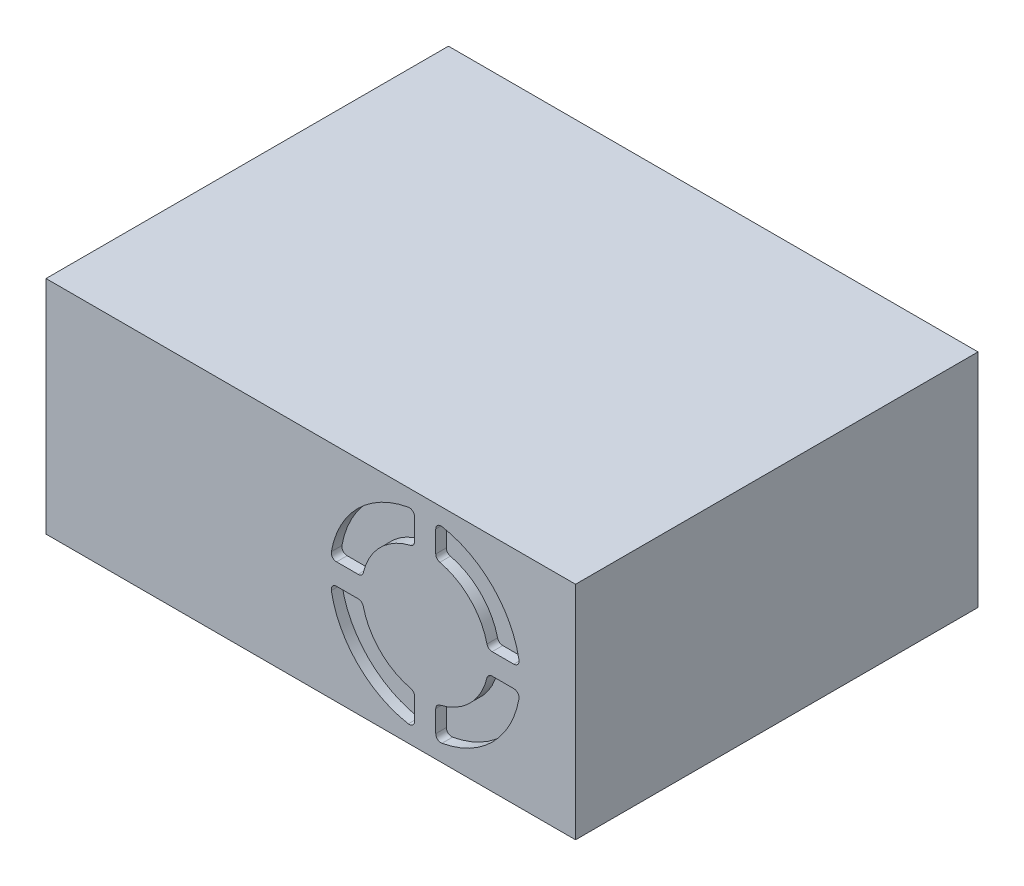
ISO-10303-21;
HEADER;
FILE_DESCRIPTION(('STEP AP214'),'2;1');
FILE_NAME('part.step','',(''),(''),'','','');
FILE_SCHEMA(('AUTOMOTIVE_DESIGN { 1 0 10303 214 1 1 1 1 }'));
ENDSEC;
DATA;
#1=APPLICATION_CONTEXT('core data for automotive mechanical design processes');
#2=APPLICATION_PROTOCOL_DEFINITION('international standard','automotive_design',2000,#1);
#3=PRODUCT_CONTEXT('',#1,'mechanical');
#4=PRODUCT('Part','Part','',(#3));
#5=PRODUCT_RELATED_PRODUCT_CATEGORY('part','',(#4));
#6=PRODUCT_DEFINITION_FORMATION('','',#4);
#7=PRODUCT_DEFINITION_CONTEXT('part definition',#1,'design');
#8=PRODUCT_DEFINITION('design','',#6,#7);
#9=PRODUCT_DEFINITION_SHAPE('','',#8);
#10=(LENGTH_UNIT() NAMED_UNIT(*) SI_UNIT(.MILLI.,.METRE.));
#11=(NAMED_UNIT(*) PLANE_ANGLE_UNIT() SI_UNIT($,.RADIAN.));
#12=(NAMED_UNIT(*) SI_UNIT($,.STERADIAN.) SOLID_ANGLE_UNIT());
#13=UNCERTAINTY_MEASURE_WITH_UNIT(LENGTH_MEASURE(1.E-05),#10,'distance_accuracy_value','');
#14=(GEOMETRIC_REPRESENTATION_CONTEXT(3) GLOBAL_UNCERTAINTY_ASSIGNED_CONTEXT((#13)) GLOBAL_UNIT_ASSIGNED_CONTEXT((#10,
#11,#12)) REPRESENTATION_CONTEXT('',''));
#15=CARTESIAN_POINT('',(0.,0.,0.));
#16=DIRECTION('',(0.,0.,1.));
#17=DIRECTION('',(1.,0.,0.));
#18=AXIS2_PLACEMENT_3D('',#15,#16,#17);
#19=CARTESIAN_POINT('',(0.,20.9,0.));
#20=DIRECTION('',(1.,0.,0.));
#21=DIRECTION('',(0.,0.,-1.));
#22=AXIS2_PLACEMENT_3D('',#19,#20,#21);
#23=PLANE('',#22);
#24=DIRECTION('',(0.,0.,1.));
#25=VECTOR('',#24,1.);
#26=CARTESIAN_POINT('',(0.,0.,0.));
#27=LINE('',#26,#25);
#28=CARTESIAN_POINT('',(0.,0.,-38.));
#29=VERTEX_POINT('',#28);
#30=CARTESIAN_POINT('',(0.,0.,0.));
#31=VERTEX_POINT('',#30);
#32=EDGE_CURVE('E513',#29,#31,#27,.T.);
#33=ORIENTED_EDGE('',*,*,#32,.T.);
#34=DIRECTION('',(0.,-1.,0.));
#35=VECTOR('',#34,1.);
#36=CARTESIAN_POINT('',(0.,20.9,0.));
#37=LINE('',#36,#35);
#38=CARTESIAN_POINT('',(0.,20.9,0.));
#39=VERTEX_POINT('',#38);
#40=EDGE_CURVE('E11',#39,#31,#37,.T.);
#41=ORIENTED_EDGE('',*,*,#40,.F.);
#42=DIRECTION('',(0.,0.,1.));
#43=VECTOR('',#42,1.);
#44=CARTESIAN_POINT('',(0.,20.9,0.));
#45=LINE('',#44,#43);
#46=CARTESIAN_POINT('',(0.,20.9,-38.));
#47=VERTEX_POINT('',#46);
#48=EDGE_CURVE('E528',#47,#39,#45,.T.);
#49=ORIENTED_EDGE('',*,*,#48,.F.);
#50=DIRECTION('',(0.,-1.,0.));
#51=VECTOR('',#50,1.);
#52=CARTESIAN_POINT('',(0.,20.9,-38.));
#53=LINE('',#52,#51);
#54=EDGE_CURVE('E538',#47,#29,#53,.T.);
#55=ORIENTED_EDGE('',*,*,#54,.T.);
#56=EDGE_LOOP('',(#33,#41,#49,#55));
#57=FACE_BOUND('',#56,.T.);
#58=ADVANCED_FACE('F33',(#57),#23,.F.);
#59=CARTESIAN_POINT('',(0.,20.9,0.));
#60=DIRECTION('',(0.,0.,-1.));
#61=DIRECTION('',(-1.,0.,0.));
#62=AXIS2_PLACEMENT_3D('',#59,#60,#61);
#63=PLANE('',#62);
#64=CARTESIAN_POINT('',(35.8,10.45,0.));
#65=DIRECTION('',(0.,0.,-1.));
#66=DIRECTION('',(1.,0.,0.));
#67=AXIS2_PLACEMENT_3D('',#64,#65,#66);
#68=CIRCLE('',#67,5.99999999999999);
#69=CARTESIAN_POINT('',(29.9619489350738,11.8346153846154,0.));
#70=VERTEX_POINT('',#69);
#71=CARTESIAN_POINT('',(34.4153846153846,16.2880510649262,0.));
#72=VERTEX_POINT('',#71);
#73=EDGE_CURVE('E430',#70,#72,#68,.T.);
#74=ORIENTED_EDGE('',*,*,#73,.F.);
#75=CARTESIAN_POINT('',(29.4754446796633,11.95,0.));
#76=DIRECTION('',(0.,0.,1.));
#77=DIRECTION('',(-1.,0.,0.));
#78=AXIS2_PLACEMENT_3D('',#75,#76,#77);
#79=CIRCLE('',#78,0.499999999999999);
#80=CARTESIAN_POINT('',(29.4754446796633,11.45,0.));
#81=VERTEX_POINT('',#80);
#82=EDGE_CURVE('E47',#81,#70,#79,.T.);
#83=ORIENTED_EDGE('',*,*,#82,.F.);
#84=DIRECTION('',(1.,0.,0.));
#85=VECTOR('',#84,1.);
#86=CARTESIAN_POINT('',(27.4333997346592,11.45,0.));
#87=LINE('',#86,#85);
#88=CARTESIAN_POINT('',(27.4333997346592,11.45,0.));
#89=VERTEX_POINT('',#88);
#90=EDGE_CURVE('E407',#89,#81,#87,.T.);
#91=ORIENTED_EDGE('',*,*,#90,.F.);
#92=CARTESIAN_POINT('',(27.4333997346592,11.95,0.));
#93=DIRECTION('',(0.,0.,1.));
#94=DIRECTION('',(-1.,0.,0.));
#95=AXIS2_PLACEMENT_3D('',#92,#93,#94);
#96=CIRCLE('',#95,0.500000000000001);
#97=CARTESIAN_POINT('',(26.9412467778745,12.0382352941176,0.));
#98=VERTEX_POINT('',#97);
#99=EDGE_CURVE('E445',#98,#89,#96,.T.);
#100=ORIENTED_EDGE('',*,*,#99,.F.);
#101=CARTESIAN_POINT('',(35.8,10.45,0.));
#102=DIRECTION('',(0.,0.,1.));
#103=DIRECTION('',(1.,0.,0.));
#104=AXIS2_PLACEMENT_3D('',#101,#102,#103);
#105=CIRCLE('',#104,9.);
#106=CARTESIAN_POINT('',(34.2117647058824,19.3087532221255,0.));
#107=VERTEX_POINT('',#106);
#108=EDGE_CURVE('E442',#107,#98,#105,.T.);
#109=ORIENTED_EDGE('',*,*,#108,.F.);
#110=CARTESIAN_POINT('',(34.3,18.8166002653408,0.));
#111=DIRECTION('',(0.,0.,1.));
#112=DIRECTION('',(-1.,0.,0.));
#113=AXIS2_PLACEMENT_3D('',#110,#111,#112);
#114=CIRCLE('',#113,0.500000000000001);
#115=CARTESIAN_POINT('',(34.8,18.8166002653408,0.));
#116=VERTEX_POINT('',#115);
#117=EDGE_CURVE('E439',#116,#107,#114,.T.);
#118=ORIENTED_EDGE('',*,*,#117,.F.);
#119=DIRECTION('',(0.,1.,0.));
#120=VECTOR('',#119,1.);
#121=CARTESIAN_POINT('',(34.8,18.8166002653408,0.));
#122=LINE('',#121,#120);
#123=CARTESIAN_POINT('',(34.8,16.7745553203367,0.));
#124=VERTEX_POINT('',#123);
#125=EDGE_CURVE('E436',#124,#116,#122,.T.);
#126=ORIENTED_EDGE('',*,*,#125,.F.);
#127=CARTESIAN_POINT('',(34.3,16.7745553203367,0.));
#128=DIRECTION('',(0.,0.,1.));
#129=DIRECTION('',(-1.,0.,0.));
#130=AXIS2_PLACEMENT_3D('',#127,#128,#129);
#131=CIRCLE('',#130,0.499999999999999);
#132=EDGE_CURVE('E433',#72,#124,#131,.T.);
#133=ORIENTED_EDGE('',*,*,#132,.F.);
#134=EDGE_LOOP('',(#74,#83,#91,#100,#109,#118,#126,#133));
#135=FACE_BOUND('',#134,.T.);
#136=DIRECTION('',(0.,1.,0.));
#137=VECTOR('',#136,1.);
#138=CARTESIAN_POINT('',(34.8,4.12544467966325,0.));
#139=LINE('',#138,#137);
#140=CARTESIAN_POINT('',(34.8,2.08339973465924,0.));
#141=VERTEX_POINT('',#140);
#142=CARTESIAN_POINT('',(34.8,4.12544467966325,0.));
#143=VERTEX_POINT('',#142);
#144=EDGE_CURVE('E368',#141,#143,#139,.T.);
#145=ORIENTED_EDGE('',*,*,#144,.F.);
#146=CARTESIAN_POINT('',(34.3,2.08339973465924,0.));
#147=DIRECTION('',(0.,0.,1.));
#148=DIRECTION('',(1.,0.,0.));
#149=AXIS2_PLACEMENT_3D('',#146,#147,#148);
#150=CIRCLE('',#149,0.500000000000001);
#151=CARTESIAN_POINT('',(34.2117647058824,1.59124677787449,0.));
#152=VERTEX_POINT('',#151);
#153=EDGE_CURVE('E55',#152,#141,#150,.T.);
#154=ORIENTED_EDGE('',*,*,#153,.F.);
#155=CARTESIAN_POINT('',(35.8,10.45,0.));
#156=DIRECTION('',(0.,0.,1.));
#157=DIRECTION('',(1.,0.,0.));
#158=AXIS2_PLACEMENT_3D('',#155,#156,#157);
#159=CIRCLE('',#158,9.);
#160=CARTESIAN_POINT('',(26.9412467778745,8.86176470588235,0.));
#161=VERTEX_POINT('',#160);
#162=EDGE_CURVE('E345',#161,#152,#159,.T.);
#163=ORIENTED_EDGE('',*,*,#162,.F.);
#164=CARTESIAN_POINT('',(27.4333997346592,8.95,0.));
#165=DIRECTION('',(0.,0.,1.));
#166=DIRECTION('',(1.,0.,0.));
#167=AXIS2_PLACEMENT_3D('',#164,#165,#166);
#168=CIRCLE('',#167,0.500000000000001);
#169=CARTESIAN_POINT('',(27.4333997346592,9.45,0.));
#170=VERTEX_POINT('',#169);
#171=EDGE_CURVE('E384',#170,#161,#168,.T.);
#172=ORIENTED_EDGE('',*,*,#171,.F.);
#173=DIRECTION('',(-1.,0.,0.));
#174=VECTOR('',#173,1.);
#175=CARTESIAN_POINT('',(27.4333997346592,9.45,0.));
#176=LINE('',#175,#174);
#177=CARTESIAN_POINT('',(29.4754446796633,9.45,0.));
#178=VERTEX_POINT('',#177);
#179=EDGE_CURVE('E381',#178,#170,#176,.T.);
#180=ORIENTED_EDGE('',*,*,#179,.F.);
#181=CARTESIAN_POINT('',(29.4754446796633,8.95,0.));
#182=DIRECTION('',(0.,0.,1.));
#183=DIRECTION('',(1.,0.,0.));
#184=AXIS2_PLACEMENT_3D('',#181,#182,#183);
#185=CIRCLE('',#184,0.499999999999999);
#186=CARTESIAN_POINT('',(29.9619489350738,9.06538461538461,0.));
#187=VERTEX_POINT('',#186);
#188=EDGE_CURVE('E378',#187,#178,#185,.T.);
#189=ORIENTED_EDGE('',*,*,#188,.F.);
#190=CARTESIAN_POINT('',(35.8,10.45,0.));
#191=DIRECTION('',(0.,0.,-1.));
#192=DIRECTION('',(1.,0.,0.));
#193=AXIS2_PLACEMENT_3D('',#190,#191,#192);
#194=CIRCLE('',#193,5.99999999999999);
#195=CARTESIAN_POINT('',(34.4153846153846,4.61194893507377,0.));
#196=VERTEX_POINT('',#195);
#197=EDGE_CURVE('E375',#196,#187,#194,.T.);
#198=ORIENTED_EDGE('',*,*,#197,.F.);
#199=CARTESIAN_POINT('',(34.3,4.12544467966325,0.));
#200=DIRECTION('',(0.,0.,1.));
#201=DIRECTION('',(-1.,0.,0.));
#202=AXIS2_PLACEMENT_3D('',#199,#200,#201);
#203=CIRCLE('',#202,0.5);
#204=EDGE_CURVE('E372',#143,#196,#203,.T.);
#205=ORIENTED_EDGE('',*,*,#204,.F.);
#206=EDGE_LOOP('',(#145,#154,#163,#172,#180,#189,#198,#205));
#207=FACE_BOUND('',#206,.T.);
#208=DIRECTION('',(-1.,0.,0.));
#209=VECTOR('',#208,1.);
#210=CARTESIAN_POINT('',(42.1245553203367,9.45,0.));
#211=LINE('',#210,#209);
#212=CARTESIAN_POINT('',(44.1666002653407,9.45,0.));
#213=VERTEX_POINT('',#212);
#214=CARTESIAN_POINT('',(42.1245553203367,9.45,0.));
#215=VERTEX_POINT('',#214);
#216=EDGE_CURVE('E310',#213,#215,#211,.T.);
#217=ORIENTED_EDGE('',*,*,#216,.F.);
#218=CARTESIAN_POINT('',(44.1666002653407,8.95,0.));
#219=DIRECTION('',(0.,0.,1.));
#220=DIRECTION('',(1.,0.,0.));
#221=AXIS2_PLACEMENT_3D('',#218,#219,#220);
#222=CIRCLE('',#221,0.500000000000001);
#223=CARTESIAN_POINT('',(44.6587532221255,8.86176470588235,0.));
#224=VERTEX_POINT('',#223);
#225=EDGE_CURVE('E272',#224,#213,#222,.T.);
#226=ORIENTED_EDGE('',*,*,#225,.F.);
#227=CARTESIAN_POINT('',(35.8,10.45,0.));
#228=DIRECTION('',(0.,0.,1.));
#229=DIRECTION('',(1.,0.,0.));
#230=AXIS2_PLACEMENT_3D('',#227,#228,#229);
#231=CIRCLE('',#230,9.);
#232=CARTESIAN_POINT('',(37.3882352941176,1.59124677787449,0.));
#233=VERTEX_POINT('',#232);
#234=EDGE_CURVE('E290',#233,#224,#231,.T.);
#235=ORIENTED_EDGE('',*,*,#234,.F.);
#236=CARTESIAN_POINT('',(37.3,2.08339973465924,0.));
#237=DIRECTION('',(0.,0.,1.));
#238=DIRECTION('',(-1.,0.,0.));
#239=AXIS2_PLACEMENT_3D('',#236,#237,#238);
#240=CIRCLE('',#239,0.500000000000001);
#241=CARTESIAN_POINT('',(36.8,2.08339973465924,0.));
#242=VERTEX_POINT('',#241);
#243=EDGE_CURVE('E293',#242,#233,#240,.T.);
#244=ORIENTED_EDGE('',*,*,#243,.F.);
#245=DIRECTION('',(0.,-1.,0.));
#246=VECTOR('',#245,1.);
#247=CARTESIAN_POINT('',(36.8,4.12544467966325,0.));
#248=LINE('',#247,#246);
#249=CARTESIAN_POINT('',(36.8,4.12544467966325,0.));
#250=VERTEX_POINT('',#249);
#251=EDGE_CURVE('E322',#250,#242,#248,.T.);
#252=ORIENTED_EDGE('',*,*,#251,.F.);
#253=CARTESIAN_POINT('',(37.3,4.12544467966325,0.));
#254=DIRECTION('',(0.,0.,1.));
#255=DIRECTION('',(1.,0.,0.));
#256=AXIS2_PLACEMENT_3D('',#253,#254,#255);
#257=CIRCLE('',#256,0.5);
#258=CARTESIAN_POINT('',(37.1846153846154,4.61194893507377,0.));
#259=VERTEX_POINT('',#258);
#260=EDGE_CURVE('E319',#259,#250,#257,.T.);
#261=ORIENTED_EDGE('',*,*,#260,.F.);
#262=CARTESIAN_POINT('',(35.8,10.45,0.));
#263=DIRECTION('',(0.,0.,-1.));
#264=DIRECTION('',(1.,0.,0.));
#265=AXIS2_PLACEMENT_3D('',#262,#263,#264);
#266=CIRCLE('',#265,5.99999999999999);
#267=CARTESIAN_POINT('',(41.6380510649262,9.06538461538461,0.));
#268=VERTEX_POINT('',#267);
#269=EDGE_CURVE('E316',#268,#259,#266,.T.);
#270=ORIENTED_EDGE('',*,*,#269,.F.);
#271=CARTESIAN_POINT('',(42.1245553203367,8.95,0.));
#272=DIRECTION('',(0.,0.,1.));
#273=DIRECTION('',(1.,0.,0.));
#274=AXIS2_PLACEMENT_3D('',#271,#272,#273);
#275=CIRCLE('',#274,0.499999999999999);
#276=EDGE_CURVE('E313',#215,#268,#275,.T.);
#277=ORIENTED_EDGE('',*,*,#276,.F.);
#278=EDGE_LOOP('',(#217,#226,#235,#244,#252,#261,#270,#277));
#279=FACE_BOUND('',#278,.T.);
#280=DIRECTION('',(0.,-1.,0.));
#281=VECTOR('',#280,1.);
#282=CARTESIAN_POINT('',(36.8,18.8166002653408,0.));
#283=LINE('',#282,#281);
#284=CARTESIAN_POINT('',(36.8,18.8166002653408,0.));
#285=VERTEX_POINT('',#284);
#286=CARTESIAN_POINT('',(36.8,16.7745553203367,0.));
#287=VERTEX_POINT('',#286);
#288=EDGE_CURVE('E491',#285,#287,#283,.T.);
#289=ORIENTED_EDGE('',*,*,#288,.F.);
#290=CARTESIAN_POINT('',(37.3,18.8166002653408,0.));
#291=DIRECTION('',(0.,0.,1.));
#292=DIRECTION('',(1.,0.,0.));
#293=AXIS2_PLACEMENT_3D('',#290,#291,#292);
#294=CIRCLE('',#293,0.500000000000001);
#295=CARTESIAN_POINT('',(37.3882352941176,19.3087532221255,0.));
#296=VERTEX_POINT('',#295);
#297=EDGE_CURVE('E329',#296,#285,#294,.T.);
#298=ORIENTED_EDGE('',*,*,#297,.F.);
#299=CARTESIAN_POINT('',(35.8,10.45,0.));
#300=DIRECTION('',(0.,0.,1.));
#301=DIRECTION('',(1.,0.,0.));
#302=AXIS2_PLACEMENT_3D('',#299,#300,#301);
#303=CIRCLE('',#302,9.);
#304=CARTESIAN_POINT('',(44.6587532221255,12.0382352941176,0.));
#305=VERTEX_POINT('',#304);
#306=EDGE_CURVE('E468',#305,#296,#303,.T.);
#307=ORIENTED_EDGE('',*,*,#306,.F.);
#308=CARTESIAN_POINT('',(44.1666002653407,11.95,0.));
#309=DIRECTION('',(0.,0.,1.));
#310=DIRECTION('',(-1.,0.,0.));
#311=AXIS2_PLACEMENT_3D('',#308,#309,#310);
#312=CIRCLE('',#311,0.500000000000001);
#313=CARTESIAN_POINT('',(44.1666002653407,11.45,0.));
#314=VERTEX_POINT('',#313);
#315=EDGE_CURVE('E506',#314,#305,#312,.T.);
#316=ORIENTED_EDGE('',*,*,#315,.F.);
#317=DIRECTION('',(1.,0.,0.));
#318=VECTOR('',#317,1.);
#319=CARTESIAN_POINT('',(42.1245553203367,11.45,0.));
#320=LINE('',#319,#318);
#321=CARTESIAN_POINT('',(42.1245553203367,11.45,0.));
#322=VERTEX_POINT('',#321);
#323=EDGE_CURVE('E503',#322,#314,#320,.T.);
#324=ORIENTED_EDGE('',*,*,#323,.F.);
#325=CARTESIAN_POINT('',(42.1245553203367,11.95,0.));
#326=DIRECTION('',(0.,0.,1.));
#327=DIRECTION('',(-1.,0.,0.));
#328=AXIS2_PLACEMENT_3D('',#325,#326,#327);
#329=CIRCLE('',#328,0.499999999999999);
#330=CARTESIAN_POINT('',(41.6380510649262,11.8346153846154,0.));
#331=VERTEX_POINT('',#330);
#332=EDGE_CURVE('E500',#331,#322,#329,.T.);
#333=ORIENTED_EDGE('',*,*,#332,.F.);
#334=CARTESIAN_POINT('',(35.8,10.45,0.));
#335=DIRECTION('',(0.,0.,-1.));
#336=DIRECTION('',(1.,0.,0.));
#337=AXIS2_PLACEMENT_3D('',#334,#335,#336);
#338=CIRCLE('',#337,5.99999999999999);
#339=CARTESIAN_POINT('',(37.1846153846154,16.2880510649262,0.));
#340=VERTEX_POINT('',#339);
#341=EDGE_CURVE('E497',#340,#331,#338,.T.);
#342=ORIENTED_EDGE('',*,*,#341,.F.);
#343=CARTESIAN_POINT('',(37.3,16.7745553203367,0.));
#344=DIRECTION('',(0.,0.,1.));
#345=DIRECTION('',(1.,0.,0.));
#346=AXIS2_PLACEMENT_3D('',#343,#344,#345);
#347=CIRCLE('',#346,0.499999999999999);
#348=EDGE_CURVE('E494',#287,#340,#347,.T.);
#349=ORIENTED_EDGE('',*,*,#348,.F.);
#350=EDGE_LOOP('',(#289,#298,#307,#316,#324,#333,#342,#349));
#351=FACE_BOUND('',#350,.T.);
#352=DIRECTION('',(1.,0.,0.));
#353=VECTOR('',#352,1.);
#354=CARTESIAN_POINT('',(0.,0.,0.));
#355=LINE('',#354,#353);
#356=CARTESIAN_POINT('',(50.,0.,0.));
#357=VERTEX_POINT('',#356);
#358=EDGE_CURVE('E541',#31,#357,#355,.T.);
#359=ORIENTED_EDGE('',*,*,#358,.T.);
#360=DIRECTION('',(0.,-1.,0.));
#361=VECTOR('',#360,1.);
#362=CARTESIAN_POINT('',(50.,20.9,0.));
#363=LINE('',#362,#361);
#364=CARTESIAN_POINT('',(50.,20.9,0.));
#365=VERTEX_POINT('',#364);
#366=EDGE_CURVE('E40',#365,#357,#363,.T.);
#367=ORIENTED_EDGE('',*,*,#366,.F.);
#368=DIRECTION('',(1.,0.,0.));
#369=VECTOR('',#368,1.);
#370=CARTESIAN_POINT('',(0.,20.9,0.));
#371=LINE('',#370,#369);
#372=EDGE_CURVE('E531',#39,#365,#371,.T.);
#373=ORIENTED_EDGE('',*,*,#372,.F.);
#374=ORIENTED_EDGE('',*,*,#40,.T.);
#375=EDGE_LOOP('',(#359,#367,#373,#374));
#376=FACE_BOUND('',#375,.T.);
#377=ADVANCED_FACE('F571',(#135,#207,#279,#351,#376),#63,.F.);
#378=CARTESIAN_POINT('',(50.,20.9,0.));
#379=DIRECTION('',(-1.,0.,0.));
#380=DIRECTION('',(0.,0.,1.));
#381=AXIS2_PLACEMENT_3D('',#378,#379,#380);
#382=PLANE('',#381);
#383=DIRECTION('',(0.,0.,-1.));
#384=VECTOR('',#383,1.);
#385=CARTESIAN_POINT('',(50.,0.,0.));
#386=LINE('',#385,#384);
#387=CARTESIAN_POINT('',(50.,0.,-38.));
#388=VERTEX_POINT('',#387);
#389=EDGE_CURVE('E543',#357,#388,#386,.T.);
#390=ORIENTED_EDGE('',*,*,#389,.T.);
#391=DIRECTION('',(0.,-1.,0.));
#392=VECTOR('',#391,1.);
#393=CARTESIAN_POINT('',(50.,20.9,-38.));
#394=LINE('',#393,#392);
#395=CARTESIAN_POINT('',(50.,20.9,-38.));
#396=VERTEX_POINT('',#395);
#397=EDGE_CURVE('E548',#396,#388,#394,.T.);
#398=ORIENTED_EDGE('',*,*,#397,.F.);
#399=DIRECTION('',(0.,0.,-1.));
#400=VECTOR('',#399,1.);
#401=CARTESIAN_POINT('',(50.,20.9,0.));
#402=LINE('',#401,#400);
#403=EDGE_CURVE('E534',#365,#396,#402,.T.);
#404=ORIENTED_EDGE('',*,*,#403,.F.);
#405=ORIENTED_EDGE('',*,*,#366,.T.);
#406=EDGE_LOOP('',(#390,#398,#404,#405));
#407=FACE_BOUND('',#406,.T.);
#408=ADVANCED_FACE('F555',(#407),#382,.F.);
#409=CARTESIAN_POINT('',(0.,20.9,-38.));
#410=DIRECTION('',(0.,0.,1.));
#411=DIRECTION('',(1.,0.,0.));
#412=AXIS2_PLACEMENT_3D('',#409,#410,#411);
#413=PLANE('',#412);
#414=DIRECTION('',(-1.,0.,0.));
#415=VECTOR('',#414,1.);
#416=CARTESIAN_POINT('',(0.,0.,-38.));
#417=LINE('',#416,#415);
#418=EDGE_CURVE('E532',#388,#29,#417,.T.);
#419=ORIENTED_EDGE('',*,*,#418,.T.);
#420=ORIENTED_EDGE('',*,*,#54,.F.);
#421=DIRECTION('',(-1.,0.,0.));
#422=VECTOR('',#421,1.);
#423=CARTESIAN_POINT('',(0.,20.9,-38.));
#424=LINE('',#423,#422);
#425=EDGE_CURVE('E536',#396,#47,#424,.T.);
#426=ORIENTED_EDGE('',*,*,#425,.F.);
#427=ORIENTED_EDGE('',*,*,#397,.T.);
#428=EDGE_LOOP('',(#419,#420,#426,#427));
#429=FACE_BOUND('',#428,.T.);
#430=ADVANCED_FACE('F564',(#429),#413,.F.);
#431=CARTESIAN_POINT('',(0.,20.9,0.));
#432=DIRECTION('',(0.,-1.,0.));
#433=DIRECTION('',(0.,0.,-1.));
#434=AXIS2_PLACEMENT_3D('',#431,#432,#433);
#435=PLANE('',#434);
#436=ORIENTED_EDGE('',*,*,#48,.T.);
#437=ORIENTED_EDGE('',*,*,#372,.T.);
#438=ORIENTED_EDGE('',*,*,#403,.T.);
#439=ORIENTED_EDGE('',*,*,#425,.T.);
#440=EDGE_LOOP('',(#436,#437,#438,#439));
#441=FACE_BOUND('',#440,.T.);
#442=ADVANCED_FACE('F570',(#441),#435,.F.);
#443=CARTESIAN_POINT('',(0.,0.,0.));
#444=DIRECTION('',(0.,-1.,0.));
#445=DIRECTION('',(0.,0.,-1.));
#446=AXIS2_PLACEMENT_3D('',#443,#444,#445);
#447=PLANE('',#446);
#448=ORIENTED_EDGE('',*,*,#32,.F.);
#449=ORIENTED_EDGE('',*,*,#418,.F.);
#450=ORIENTED_EDGE('',*,*,#389,.F.);
#451=ORIENTED_EDGE('',*,*,#358,.F.);
#452=EDGE_LOOP('',(#448,#449,#450,#451));
#453=FACE_BOUND('',#452,.T.);
#454=ADVANCED_FACE('F561',(#453),#447,.T.);
#455=CARTESIAN_POINT('',(37.3,18.8166002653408,-1.));
#456=DIRECTION('',(0.,0.,1.));
#457=DIRECTION('',(1.,0.,0.));
#458=AXIS2_PLACEMENT_3D('',#455,#456,#457);
#459=CYLINDRICAL_SURFACE('',#458,0.500000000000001);
#460=ORIENTED_EDGE('',*,*,#297,.T.);
#461=DIRECTION('',(0.,0.,1.));
#462=VECTOR('',#461,1.);
#463=CARTESIAN_POINT('',(36.8,18.8166002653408,-1.));
#464=LINE('',#463,#462);
#465=CARTESIAN_POINT('',(36.8,18.8166002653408,-1.));
#466=VERTEX_POINT('',#465);
#467=EDGE_CURVE('E489',#466,#285,#464,.T.);
#468=ORIENTED_EDGE('',*,*,#467,.F.);
#469=CARTESIAN_POINT('',(37.3,18.8166002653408,-1.));
#470=DIRECTION('',(0.,0.,1.));
#471=DIRECTION('',(1.,0.,0.));
#472=AXIS2_PLACEMENT_3D('',#469,#470,#471);
#473=CIRCLE('',#472,0.500000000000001);
#474=CARTESIAN_POINT('',(37.3882352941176,19.3087532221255,-1.));
#475=VERTEX_POINT('',#474);
#476=EDGE_CURVE('E464',#475,#466,#473,.T.);
#477=ORIENTED_EDGE('',*,*,#476,.F.);
#478=DIRECTION('',(0.,0.,1.));
#479=VECTOR('',#478,1.);
#480=CARTESIAN_POINT('',(37.3882352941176,19.3087532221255,-1.));
#481=LINE('',#480,#479);
#482=EDGE_CURVE('E511',#475,#296,#481,.T.);
#483=ORIENTED_EDGE('',*,*,#482,.T.);
#484=EDGE_LOOP('',(#460,#468,#477,#483));
#485=FACE_BOUND('',#484,.T.);
#486=ADVANCED_FACE('F586',(#485),#459,.F.);
#487=CARTESIAN_POINT('',(35.8,10.45,-1.));
#488=DIRECTION('',(0.,0.,1.));
#489=DIRECTION('',(1.,0.,0.));
#490=AXIS2_PLACEMENT_3D('',#487,#488,#489);
#491=CYLINDRICAL_SURFACE('',#490,9.);
#492=ORIENTED_EDGE('',*,*,#306,.T.);
#493=ORIENTED_EDGE('',*,*,#482,.F.);
#494=CARTESIAN_POINT('',(35.8,10.45,-1.));
#495=DIRECTION('',(0.,0.,1.));
#496=DIRECTION('',(1.,0.,0.));
#497=AXIS2_PLACEMENT_3D('',#494,#495,#496);
#498=CIRCLE('',#497,9.);
#499=CARTESIAN_POINT('',(44.6587532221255,12.0382352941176,-1.));
#500=VERTEX_POINT('',#499);
#501=EDGE_CURVE('E486',#500,#475,#498,.T.);
#502=ORIENTED_EDGE('',*,*,#501,.F.);
#503=DIRECTION('',(0.,0.,1.));
#504=VECTOR('',#503,1.);
#505=CARTESIAN_POINT('',(44.6587532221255,12.0382352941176,-1.));
#506=LINE('',#505,#504);
#507=EDGE_CURVE('E514',#500,#305,#506,.T.);
#508=ORIENTED_EDGE('',*,*,#507,.T.);
#509=EDGE_LOOP('',(#492,#493,#502,#508));
#510=FACE_BOUND('',#509,.T.);
#511=ADVANCED_FACE('F591',(#510),#491,.F.);
#512=CARTESIAN_POINT('',(44.1666002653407,11.95,-1.));
#513=DIRECTION('',(0.,0.,1.));
#514=DIRECTION('',(1.,0.,0.));
#515=AXIS2_PLACEMENT_3D('',#512,#513,#514);
#516=CYLINDRICAL_SURFACE('',#515,0.500000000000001);
#517=ORIENTED_EDGE('',*,*,#315,.T.);
#518=ORIENTED_EDGE('',*,*,#507,.F.);
#519=CARTESIAN_POINT('',(44.1666002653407,11.95,-1.));
#520=DIRECTION('',(0.,0.,1.));
#521=DIRECTION('',(-1.,0.,0.));
#522=AXIS2_PLACEMENT_3D('',#519,#520,#521);
#523=CIRCLE('',#522,0.500000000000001);
#524=CARTESIAN_POINT('',(44.1666002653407,11.45,-1.));
#525=VERTEX_POINT('',#524);
#526=EDGE_CURVE('E483',#525,#500,#523,.T.);
#527=ORIENTED_EDGE('',*,*,#526,.F.);
#528=DIRECTION('',(0.,0.,1.));
#529=VECTOR('',#528,1.);
#530=CARTESIAN_POINT('',(44.1666002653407,11.45,-1.));
#531=LINE('',#530,#529);
#532=EDGE_CURVE('E516',#525,#314,#531,.T.);
#533=ORIENTED_EDGE('',*,*,#532,.T.);
#534=EDGE_LOOP('',(#517,#518,#527,#533));
#535=FACE_BOUND('',#534,.T.);
#536=ADVANCED_FACE('F613',(#535),#516,.F.);
#537=CARTESIAN_POINT('',(42.1245553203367,11.45,-1.));
#538=DIRECTION('',(0.,-1.,0.));
#539=DIRECTION('',(0.,0.,-1.));
#540=AXIS2_PLACEMENT_3D('',#537,#538,#539);
#541=PLANE('',#540);
#542=ORIENTED_EDGE('',*,*,#323,.T.);
#543=ORIENTED_EDGE('',*,*,#532,.F.);
#544=DIRECTION('',(1.,0.,0.));
#545=VECTOR('',#544,1.);
#546=CARTESIAN_POINT('',(42.1245553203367,11.45,-1.));
#547=LINE('',#546,#545);
#548=CARTESIAN_POINT('',(42.1245553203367,11.45,-1.));
#549=VERTEX_POINT('',#548);
#550=EDGE_CURVE('E480',#549,#525,#547,.T.);
#551=ORIENTED_EDGE('',*,*,#550,.F.);
#552=DIRECTION('',(0.,0.,1.));
#553=VECTOR('',#552,1.);
#554=CARTESIAN_POINT('',(42.1245553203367,11.45,-1.));
#555=LINE('',#554,#553);
#556=EDGE_CURVE('E518',#549,#322,#555,.T.);
#557=ORIENTED_EDGE('',*,*,#556,.T.);
#558=EDGE_LOOP('',(#542,#543,#551,#557));
#559=FACE_BOUND('',#558,.T.);
#560=ADVANCED_FACE('F609',(#559),#541,.F.);
#561=CARTESIAN_POINT('',(42.1245553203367,11.95,-1.));
#562=DIRECTION('',(0.,0.,1.));
#563=DIRECTION('',(1.,0.,0.));
#564=AXIS2_PLACEMENT_3D('',#561,#562,#563);
#565=CYLINDRICAL_SURFACE('',#564,0.499999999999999);
#566=ORIENTED_EDGE('',*,*,#332,.T.);
#567=ORIENTED_EDGE('',*,*,#556,.F.);
#568=CARTESIAN_POINT('',(42.1245553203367,11.95,-1.));
#569=DIRECTION('',(0.,0.,1.));
#570=DIRECTION('',(-1.,0.,0.));
#571=AXIS2_PLACEMENT_3D('',#568,#569,#570);
#572=CIRCLE('',#571,0.499999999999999);
#573=CARTESIAN_POINT('',(41.6380510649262,11.8346153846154,-1.));
#574=VERTEX_POINT('',#573);
#575=EDGE_CURVE('E477',#574,#549,#572,.T.);
#576=ORIENTED_EDGE('',*,*,#575,.F.);
#577=DIRECTION('',(0.,0.,1.));
#578=VECTOR('',#577,1.);
#579=CARTESIAN_POINT('',(41.6380510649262,11.8346153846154,-1.));
#580=LINE('',#579,#578);
#581=EDGE_CURVE('E520',#574,#331,#580,.T.);
#582=ORIENTED_EDGE('',*,*,#581,.T.);
#583=EDGE_LOOP('',(#566,#567,#576,#582));
#584=FACE_BOUND('',#583,.T.);
#585=ADVANCED_FACE('F605',(#584),#565,.F.);
#586=CARTESIAN_POINT('',(35.8,10.45,-1.));
#587=DIRECTION('',(0.,0.,1.));
#588=DIRECTION('',(1.,0.,0.));
#589=AXIS2_PLACEMENT_3D('',#586,#587,#588);
#590=CYLINDRICAL_SURFACE('',#589,5.99999999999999);
#591=ORIENTED_EDGE('',*,*,#341,.T.);
#592=ORIENTED_EDGE('',*,*,#581,.F.);
#593=CARTESIAN_POINT('',(35.8,10.45,-1.));
#594=DIRECTION('',(0.,0.,-1.));
#595=DIRECTION('',(1.,0.,0.));
#596=AXIS2_PLACEMENT_3D('',#593,#594,#595);
#597=CIRCLE('',#596,5.99999999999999);
#598=CARTESIAN_POINT('',(37.1846153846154,16.2880510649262,-1.));
#599=VERTEX_POINT('',#598);
#600=EDGE_CURVE('E474',#599,#574,#597,.T.);
#601=ORIENTED_EDGE('',*,*,#600,.F.);
#602=DIRECTION('',(0.,0.,1.));
#603=VECTOR('',#602,1.);
#604=CARTESIAN_POINT('',(37.1846153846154,16.2880510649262,-1.));
#605=LINE('',#604,#603);
#606=EDGE_CURVE('E522',#599,#340,#605,.T.);
#607=ORIENTED_EDGE('',*,*,#606,.T.);
#608=EDGE_LOOP('',(#591,#592,#601,#607));
#609=FACE_BOUND('',#608,.T.);
#610=ADVANCED_FACE('F601',(#609),#590,.T.);
#611=CARTESIAN_POINT('',(37.3,16.7745553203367,-1.));
#612=DIRECTION('',(0.,0.,1.));
#613=DIRECTION('',(1.,0.,0.));
#614=AXIS2_PLACEMENT_3D('',#611,#612,#613);
#615=CYLINDRICAL_SURFACE('',#614,0.499999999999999);
#616=ORIENTED_EDGE('',*,*,#348,.T.);
#617=ORIENTED_EDGE('',*,*,#606,.F.);
#618=CARTESIAN_POINT('',(37.3,16.7745553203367,-1.));
#619=DIRECTION('',(0.,0.,1.));
#620=DIRECTION('',(1.,0.,0.));
#621=AXIS2_PLACEMENT_3D('',#618,#619,#620);
#622=CIRCLE('',#621,0.499999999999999);
#623=CARTESIAN_POINT('',(36.8,16.7745553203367,-1.));
#624=VERTEX_POINT('',#623);
#625=EDGE_CURVE('E471',#624,#599,#622,.T.);
#626=ORIENTED_EDGE('',*,*,#625,.F.);
#627=DIRECTION('',(0.,0.,1.));
#628=VECTOR('',#627,1.);
#629=CARTESIAN_POINT('',(36.8,16.7745553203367,-1.));
#630=LINE('',#629,#628);
#631=EDGE_CURVE('E524',#624,#287,#630,.T.);
#632=ORIENTED_EDGE('',*,*,#631,.T.);
#633=EDGE_LOOP('',(#616,#617,#626,#632));
#634=FACE_BOUND('',#633,.T.);
#635=ADVANCED_FACE('F597',(#634),#615,.F.);
#636=CARTESIAN_POINT('',(36.8,18.8166002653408,-1.));
#637=DIRECTION('',(-1.,0.,0.));
#638=DIRECTION('',(0.,0.,1.));
#639=AXIS2_PLACEMENT_3D('',#636,#637,#638);
#640=PLANE('',#639);
#641=ORIENTED_EDGE('',*,*,#288,.T.);
#642=ORIENTED_EDGE('',*,*,#631,.F.);
#643=DIRECTION('',(0.,-1.,0.));
#644=VECTOR('',#643,1.);
#645=CARTESIAN_POINT('',(36.8,18.8166002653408,-1.));
#646=LINE('',#645,#644);
#647=EDGE_CURVE('E467',#466,#624,#646,.T.);
#648=ORIENTED_EDGE('',*,*,#647,.F.);
#649=ORIENTED_EDGE('',*,*,#467,.T.);
#650=EDGE_LOOP('',(#641,#642,#648,#649));
#651=FACE_BOUND('',#650,.T.);
#652=ADVANCED_FACE('F593',(#651),#640,.F.);
#653=CARTESIAN_POINT('',(37.3,18.8166002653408,-1.));
#654=DIRECTION('',(0.,0.,1.));
#655=DIRECTION('',(1.,0.,0.));
#656=AXIS2_PLACEMENT_3D('',#653,#654,#655);
#657=PLANE('',#656);
#658=ORIENTED_EDGE('',*,*,#476,.T.);
#659=ORIENTED_EDGE('',*,*,#647,.T.);
#660=ORIENTED_EDGE('',*,*,#625,.T.);
#661=ORIENTED_EDGE('',*,*,#600,.T.);
#662=ORIENTED_EDGE('',*,*,#575,.T.);
#663=ORIENTED_EDGE('',*,*,#550,.T.);
#664=ORIENTED_EDGE('',*,*,#526,.T.);
#665=ORIENTED_EDGE('',*,*,#501,.T.);
#666=EDGE_LOOP('',(#658,#659,#660,#661,#662,#663,#664,#665));
#667=FACE_BOUND('',#666,.T.);
#668=ADVANCED_FACE('F596',(#667),#657,.T.);
#669=CARTESIAN_POINT('',(44.1666002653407,8.95,-1.));
#670=DIRECTION('',(0.,0.,1.));
#671=DIRECTION('',(1.,0.,0.));
#672=AXIS2_PLACEMENT_3D('',#669,#670,#671);
#673=CYLINDRICAL_SURFACE('',#672,0.500000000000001);
#674=ORIENTED_EDGE('',*,*,#225,.T.);
#675=DIRECTION('',(0.,0.,1.));
#676=VECTOR('',#675,1.);
#677=CARTESIAN_POINT('',(44.1666002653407,9.45,-1.));
#678=LINE('',#677,#676);
#679=CARTESIAN_POINT('',(44.1666002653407,9.45,-1.));
#680=VERTEX_POINT('',#679);
#681=EDGE_CURVE('E265',#680,#213,#678,.T.);
#682=ORIENTED_EDGE('',*,*,#681,.F.);
#683=CARTESIAN_POINT('',(44.1666002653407,8.95,-1.));
#684=DIRECTION('',(0.,0.,1.));
#685=DIRECTION('',(1.,0.,0.));
#686=AXIS2_PLACEMENT_3D('',#683,#684,#685);
#687=CIRCLE('',#686,0.500000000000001);
#688=CARTESIAN_POINT('',(44.6587532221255,8.86176470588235,-1.));
#689=VERTEX_POINT('',#688);
#690=EDGE_CURVE('E269',#689,#680,#687,.T.);
#691=ORIENTED_EDGE('',*,*,#690,.F.);
#692=DIRECTION('',(0.,0.,1.));
#693=VECTOR('',#692,1.);
#694=CARTESIAN_POINT('',(44.6587532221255,8.86176470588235,-1.));
#695=LINE('',#694,#693);
#696=EDGE_CURVE('E327',#689,#224,#695,.T.);
#697=ORIENTED_EDGE('',*,*,#696,.T.);
#698=EDGE_LOOP('',(#674,#682,#691,#697));
#699=FACE_BOUND('',#698,.T.);
#700=ADVANCED_FACE('F267',(#699),#673,.F.);
#701=CARTESIAN_POINT('',(35.8,10.45,-1.));
#702=DIRECTION('',(0.,0.,1.));
#703=DIRECTION('',(1.,0.,0.));
#704=AXIS2_PLACEMENT_3D('',#701,#702,#703);
#705=CYLINDRICAL_SURFACE('',#704,9.);
#706=ORIENTED_EDGE('',*,*,#234,.T.);
#707=ORIENTED_EDGE('',*,*,#696,.F.);
#708=CARTESIAN_POINT('',(35.8,10.45,-1.));
#709=DIRECTION('',(0.,0.,1.));
#710=DIRECTION('',(1.,0.,0.));
#711=AXIS2_PLACEMENT_3D('',#708,#709,#710);
#712=CIRCLE('',#711,9.);
#713=CARTESIAN_POINT('',(37.3882352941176,1.59124677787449,-1.));
#714=VERTEX_POINT('',#713);
#715=EDGE_CURVE('E277',#714,#689,#712,.T.);
#716=ORIENTED_EDGE('',*,*,#715,.F.);
#717=DIRECTION('',(0.,0.,1.));
#718=VECTOR('',#717,1.);
#719=CARTESIAN_POINT('',(37.3882352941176,1.59124677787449,-1.));
#720=LINE('',#719,#718);
#721=EDGE_CURVE('E330',#714,#233,#720,.T.);
#722=ORIENTED_EDGE('',*,*,#721,.T.);
#723=EDGE_LOOP('',(#706,#707,#716,#722));
#724=FACE_BOUND('',#723,.T.);
#725=ADVANCED_FACE('F696',(#724),#705,.F.);
#726=CARTESIAN_POINT('',(37.3,2.08339973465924,-1.));
#727=DIRECTION('',(0.,0.,1.));
#728=DIRECTION('',(1.,0.,0.));
#729=AXIS2_PLACEMENT_3D('',#726,#727,#728);
#730=CYLINDRICAL_SURFACE('',#729,0.500000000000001);
#731=ORIENTED_EDGE('',*,*,#243,.T.);
#732=ORIENTED_EDGE('',*,*,#721,.F.);
#733=CARTESIAN_POINT('',(37.3,2.08339973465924,-1.));
#734=DIRECTION('',(0.,0.,1.));
#735=DIRECTION('',(-1.,0.,0.));
#736=AXIS2_PLACEMENT_3D('',#733,#734,#735);
#737=CIRCLE('',#736,0.500000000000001);
#738=CARTESIAN_POINT('',(36.8,2.08339973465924,-1.));
#739=VERTEX_POINT('',#738);
#740=EDGE_CURVE('E306',#739,#714,#737,.T.);
#741=ORIENTED_EDGE('',*,*,#740,.F.);
#742=DIRECTION('',(0.,0.,1.));
#743=VECTOR('',#742,1.);
#744=CARTESIAN_POINT('',(36.8,2.08339973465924,-1.));
#745=LINE('',#744,#743);
#746=EDGE_CURVE('E332',#739,#242,#745,.T.);
#747=ORIENTED_EDGE('',*,*,#746,.T.);
#748=EDGE_LOOP('',(#731,#732,#741,#747));
#749=FACE_BOUND('',#748,.T.);
#750=ADVANCED_FACE('F714',(#749),#730,.F.);
#751=CARTESIAN_POINT('',(36.8,4.12544467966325,-1.));
#752=DIRECTION('',(-1.,0.,0.));
#753=DIRECTION('',(0.,0.,1.));
#754=AXIS2_PLACEMENT_3D('',#751,#752,#753);
#755=PLANE('',#754);
#756=ORIENTED_EDGE('',*,*,#251,.T.);
#757=ORIENTED_EDGE('',*,*,#746,.F.);
#758=DIRECTION('',(0.,-1.,0.));
#759=VECTOR('',#758,1.);
#760=CARTESIAN_POINT('',(36.8,4.12544467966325,-1.));
#761=LINE('',#760,#759);
#762=CARTESIAN_POINT('',(36.8,4.12544467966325,-1.));
#763=VERTEX_POINT('',#762);
#764=EDGE_CURVE('E303',#763,#739,#761,.T.);
#765=ORIENTED_EDGE('',*,*,#764,.F.);
#766=DIRECTION('',(0.,0.,1.));
#767=VECTOR('',#766,1.);
#768=CARTESIAN_POINT('',(36.8,4.12544467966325,-1.));
#769=LINE('',#768,#767);
#770=EDGE_CURVE('E334',#763,#250,#769,.T.);
#771=ORIENTED_EDGE('',*,*,#770,.T.);
#772=EDGE_LOOP('',(#756,#757,#765,#771));
#773=FACE_BOUND('',#772,.T.);
#774=ADVANCED_FACE('F710',(#773),#755,.F.);
#775=CARTESIAN_POINT('',(37.3,4.12544467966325,-1.));
#776=DIRECTION('',(0.,0.,1.));
#777=DIRECTION('',(1.,0.,0.));
#778=AXIS2_PLACEMENT_3D('',#775,#776,#777);
#779=CYLINDRICAL_SURFACE('',#778,0.5);
#780=ORIENTED_EDGE('',*,*,#260,.T.);
#781=ORIENTED_EDGE('',*,*,#770,.F.);
#782=CARTESIAN_POINT('',(37.3,4.12544467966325,-1.));
#783=DIRECTION('',(0.,0.,1.));
#784=DIRECTION('',(1.,0.,0.));
#785=AXIS2_PLACEMENT_3D('',#782,#783,#784);
#786=CIRCLE('',#785,0.5);
#787=CARTESIAN_POINT('',(37.1846153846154,4.61194893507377,-1.));
#788=VERTEX_POINT('',#787);
#789=EDGE_CURVE('E300',#788,#763,#786,.T.);
#790=ORIENTED_EDGE('',*,*,#789,.F.);
#791=DIRECTION('',(0.,0.,1.));
#792=VECTOR('',#791,1.);
#793=CARTESIAN_POINT('',(37.1846153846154,4.61194893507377,-1.));
#794=LINE('',#793,#792);
#795=EDGE_CURVE('E336',#788,#259,#794,.T.);
#796=ORIENTED_EDGE('',*,*,#795,.T.);
#797=EDGE_LOOP('',(#780,#781,#790,#796));
#798=FACE_BOUND('',#797,.T.);
#799=ADVANCED_FACE('F706',(#798),#779,.F.);
#800=CARTESIAN_POINT('',(35.8,10.45,-1.));
#801=DIRECTION('',(0.,0.,1.));
#802=DIRECTION('',(1.,0.,0.));
#803=AXIS2_PLACEMENT_3D('',#800,#801,#802);
#804=CYLINDRICAL_SURFACE('',#803,5.99999999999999);
#805=ORIENTED_EDGE('',*,*,#269,.T.);
#806=ORIENTED_EDGE('',*,*,#795,.F.);
#807=CARTESIAN_POINT('',(35.8,10.45,-1.));
#808=DIRECTION('',(0.,0.,-1.));
#809=DIRECTION('',(1.,0.,0.));
#810=AXIS2_PLACEMENT_3D('',#807,#808,#809);
#811=CIRCLE('',#810,5.99999999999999);
#812=CARTESIAN_POINT('',(41.6380510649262,9.06538461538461,-1.));
#813=VERTEX_POINT('',#812);
#814=EDGE_CURVE('E297',#813,#788,#811,.T.);
#815=ORIENTED_EDGE('',*,*,#814,.F.);
#816=DIRECTION('',(0.,0.,1.));
#817=VECTOR('',#816,1.);
#818=CARTESIAN_POINT('',(41.6380510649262,9.06538461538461,-1.));
#819=LINE('',#818,#817);
#820=EDGE_CURVE('E338',#813,#268,#819,.T.);
#821=ORIENTED_EDGE('',*,*,#820,.T.);
#822=EDGE_LOOP('',(#805,#806,#815,#821));
#823=FACE_BOUND('',#822,.T.);
#824=ADVANCED_FACE('F702',(#823),#804,.T.);
#825=CARTESIAN_POINT('',(42.1245553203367,8.95,-1.));
#826=DIRECTION('',(0.,0.,1.));
#827=DIRECTION('',(1.,0.,0.));
#828=AXIS2_PLACEMENT_3D('',#825,#826,#827);
#829=CYLINDRICAL_SURFACE('',#828,0.499999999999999);
#830=ORIENTED_EDGE('',*,*,#276,.T.);
#831=ORIENTED_EDGE('',*,*,#820,.F.);
#832=CARTESIAN_POINT('',(42.1245553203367,8.95,-1.));
#833=DIRECTION('',(0.,0.,1.));
#834=DIRECTION('',(1.,0.,0.));
#835=AXIS2_PLACEMENT_3D('',#832,#833,#834);
#836=CIRCLE('',#835,0.499999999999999);
#837=CARTESIAN_POINT('',(42.1245553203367,9.45,-1.));
#838=VERTEX_POINT('',#837);
#839=EDGE_CURVE('E285',#838,#813,#836,.T.);
#840=ORIENTED_EDGE('',*,*,#839,.F.);
#841=DIRECTION('',(0.,0.,1.));
#842=VECTOR('',#841,1.);
#843=CARTESIAN_POINT('',(42.1245553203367,9.45,-1.));
#844=LINE('',#843,#842);
#845=EDGE_CURVE('E276',#838,#215,#844,.T.);
#846=ORIENTED_EDGE('',*,*,#845,.T.);
#847=EDGE_LOOP('',(#830,#831,#840,#846));
#848=FACE_BOUND('',#847,.T.);
#849=ADVANCED_FACE('F699',(#848),#829,.F.);
#850=CARTESIAN_POINT('',(42.1245553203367,9.45,-1.));
#851=DIRECTION('',(0.,1.,0.));
#852=DIRECTION('',(0.,0.,1.));
#853=AXIS2_PLACEMENT_3D('',#850,#851,#852);
#854=PLANE('',#853);
#855=ORIENTED_EDGE('',*,*,#216,.T.);
#856=ORIENTED_EDGE('',*,*,#845,.F.);
#857=DIRECTION('',(-1.,0.,0.));
#858=VECTOR('',#857,1.);
#859=CARTESIAN_POINT('',(42.1245553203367,9.45,-1.));
#860=LINE('',#859,#858);
#861=EDGE_CURVE('E280',#680,#838,#860,.T.);
#862=ORIENTED_EDGE('',*,*,#861,.F.);
#863=ORIENTED_EDGE('',*,*,#681,.T.);
#864=EDGE_LOOP('',(#855,#856,#862,#863));
#865=FACE_BOUND('',#864,.T.);
#866=ADVANCED_FACE('F281',(#865),#854,.F.);
#867=CARTESIAN_POINT('',(44.1666002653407,8.95,-1.));
#868=DIRECTION('',(0.,0.,1.));
#869=DIRECTION('',(1.,0.,0.));
#870=AXIS2_PLACEMENT_3D('',#867,#868,#869);
#871=PLANE('',#870);
#872=ORIENTED_EDGE('',*,*,#690,.T.);
#873=ORIENTED_EDGE('',*,*,#861,.T.);
#874=ORIENTED_EDGE('',*,*,#839,.T.);
#875=ORIENTED_EDGE('',*,*,#814,.T.);
#876=ORIENTED_EDGE('',*,*,#789,.T.);
#877=ORIENTED_EDGE('',*,*,#764,.T.);
#878=ORIENTED_EDGE('',*,*,#740,.T.);
#879=ORIENTED_EDGE('',*,*,#715,.T.);
#880=EDGE_LOOP('',(#872,#873,#874,#875,#876,#877,#878,#879));
#881=FACE_BOUND('',#880,.T.);
#882=ADVANCED_FACE('F287',(#881),#871,.T.);
#883=CARTESIAN_POINT('',(34.3,2.08339973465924,-1.));
#884=DIRECTION('',(0.,0.,1.));
#885=DIRECTION('',(1.,0.,0.));
#886=AXIS2_PLACEMENT_3D('',#883,#884,#885);
#887=CYLINDRICAL_SURFACE('',#886,0.500000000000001);
#888=ORIENTED_EDGE('',*,*,#153,.T.);
#889=DIRECTION('',(0.,0.,1.));
#890=VECTOR('',#889,1.);
#891=CARTESIAN_POINT('',(34.8,2.08339973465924,-1.));
#892=LINE('',#891,#890);
#893=CARTESIAN_POINT('',(34.8,2.08339973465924,-1.));
#894=VERTEX_POINT('',#893);
#895=EDGE_CURVE('E366',#894,#141,#892,.T.);
#896=ORIENTED_EDGE('',*,*,#895,.F.);
#897=CARTESIAN_POINT('',(34.3,2.08339973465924,-1.));
#898=DIRECTION('',(0.,0.,1.));
#899=DIRECTION('',(1.,0.,0.));
#900=AXIS2_PLACEMENT_3D('',#897,#898,#899);
#901=CIRCLE('',#900,0.500000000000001);
#902=CARTESIAN_POINT('',(34.2117647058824,1.59124677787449,-1.));
#903=VERTEX_POINT('',#902);
#904=EDGE_CURVE('E341',#903,#894,#901,.T.);
#905=ORIENTED_EDGE('',*,*,#904,.F.);
#906=DIRECTION('',(0.,0.,1.));
#907=VECTOR('',#906,1.);
#908=CARTESIAN_POINT('',(34.2117647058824,1.59124677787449,-1.));
#909=LINE('',#908,#907);
#910=EDGE_CURVE('E311',#903,#152,#909,.T.);
#911=ORIENTED_EDGE('',*,*,#910,.T.);
#912=EDGE_LOOP('',(#888,#896,#905,#911));
#913=FACE_BOUND('',#912,.T.);
#914=ADVANCED_FACE('F660',(#913),#887,.F.);
#915=CARTESIAN_POINT('',(35.8,10.45,-1.));
#916=DIRECTION('',(0.,0.,1.));
#917=DIRECTION('',(1.,0.,0.));
#918=AXIS2_PLACEMENT_3D('',#915,#916,#917);
#919=CYLINDRICAL_SURFACE('',#918,9.);
#920=ORIENTED_EDGE('',*,*,#162,.T.);
#921=ORIENTED_EDGE('',*,*,#910,.F.);
#922=CARTESIAN_POINT('',(35.8,10.45,-1.));
#923=DIRECTION('',(0.,0.,1.));
#924=DIRECTION('',(1.,0.,0.));
#925=AXIS2_PLACEMENT_3D('',#922,#923,#924);
#926=CIRCLE('',#925,9.);
#927=CARTESIAN_POINT('',(26.9412467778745,8.86176470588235,-1.));
#928=VERTEX_POINT('',#927);
#929=EDGE_CURVE('E363',#928,#903,#926,.T.);
#930=ORIENTED_EDGE('',*,*,#929,.F.);
#931=DIRECTION('',(0.,0.,1.));
#932=VECTOR('',#931,1.);
#933=CARTESIAN_POINT('',(26.9412467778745,8.86176470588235,-1.));
#934=LINE('',#933,#932);
#935=EDGE_CURVE('E390',#928,#161,#934,.T.);
#936=ORIENTED_EDGE('',*,*,#935,.T.);
#937=EDGE_LOOP('',(#920,#921,#930,#936));
#938=FACE_BOUND('',#937,.T.);
#939=ADVANCED_FACE('F663',(#938),#919,.F.);
#940=CARTESIAN_POINT('',(27.4333997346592,8.95,-1.));
#941=DIRECTION('',(0.,0.,1.));
#942=DIRECTION('',(1.,0.,0.));
#943=AXIS2_PLACEMENT_3D('',#940,#941,#942);
#944=CYLINDRICAL_SURFACE('',#943,0.500000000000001);
#945=ORIENTED_EDGE('',*,*,#171,.T.);
#946=ORIENTED_EDGE('',*,*,#935,.F.);
#947=CARTESIAN_POINT('',(27.4333997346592,8.95,-1.));
#948=DIRECTION('',(0.,0.,1.));
#949=DIRECTION('',(1.,0.,0.));
#950=AXIS2_PLACEMENT_3D('',#947,#948,#949);
#951=CIRCLE('',#950,0.500000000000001);
#952=CARTESIAN_POINT('',(27.4333997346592,9.45,-1.));
#953=VERTEX_POINT('',#952);
#954=EDGE_CURVE('E360',#953,#928,#951,.T.);
#955=ORIENTED_EDGE('',*,*,#954,.F.);
#956=DIRECTION('',(0.,0.,1.));
#957=VECTOR('',#956,1.);
#958=CARTESIAN_POINT('',(27.4333997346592,9.45,-1.));
#959=LINE('',#958,#957);
#960=EDGE_CURVE('E392',#953,#170,#959,.T.);
#961=ORIENTED_EDGE('',*,*,#960,.T.);
#962=EDGE_LOOP('',(#945,#946,#955,#961));
#963=FACE_BOUND('',#962,.T.);
#964=ADVANCED_FACE('F683',(#963),#944,.F.);
#965=CARTESIAN_POINT('',(27.4333997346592,9.45,-1.));
#966=DIRECTION('',(0.,1.,0.));
#967=DIRECTION('',(0.,0.,1.));
#968=AXIS2_PLACEMENT_3D('',#965,#966,#967);
#969=PLANE('',#968);
#970=ORIENTED_EDGE('',*,*,#179,.T.);
#971=ORIENTED_EDGE('',*,*,#960,.F.);
#972=DIRECTION('',(-1.,0.,0.));
#973=VECTOR('',#972,1.);
#974=CARTESIAN_POINT('',(27.4333997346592,9.45,-1.));
#975=LINE('',#974,#973);
#976=CARTESIAN_POINT('',(29.4754446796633,9.45,-1.));
#977=VERTEX_POINT('',#976);
#978=EDGE_CURVE('E357',#977,#953,#975,.T.);
#979=ORIENTED_EDGE('',*,*,#978,.F.);
#980=DIRECTION('',(0.,0.,1.));
#981=VECTOR('',#980,1.);
#982=CARTESIAN_POINT('',(29.4754446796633,9.45,-1.));
#983=LINE('',#982,#981);
#984=EDGE_CURVE('E394',#977,#178,#983,.T.);
#985=ORIENTED_EDGE('',*,*,#984,.T.);
#986=EDGE_LOOP('',(#970,#971,#979,#985));
#987=FACE_BOUND('',#986,.T.);
#988=ADVANCED_FACE('F679',(#987),#969,.F.);
#989=CARTESIAN_POINT('',(29.4754446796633,8.95,-1.));
#990=DIRECTION('',(0.,0.,1.));
#991=DIRECTION('',(1.,0.,0.));
#992=AXIS2_PLACEMENT_3D('',#989,#990,#991);
#993=CYLINDRICAL_SURFACE('',#992,0.499999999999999);
#994=ORIENTED_EDGE('',*,*,#188,.T.);
#995=ORIENTED_EDGE('',*,*,#984,.F.);
#996=CARTESIAN_POINT('',(29.4754446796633,8.95,-1.));
#997=DIRECTION('',(0.,0.,1.));
#998=DIRECTION('',(1.,0.,0.));
#999=AXIS2_PLACEMENT_3D('',#996,#997,#998);
#1000=CIRCLE('',#999,0.499999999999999);
#1001=CARTESIAN_POINT('',(29.9619489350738,9.06538461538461,-1.));
#1002=VERTEX_POINT('',#1001);
#1003=EDGE_CURVE('E354',#1002,#977,#1000,.T.);
#1004=ORIENTED_EDGE('',*,*,#1003,.F.);
#1005=DIRECTION('',(0.,0.,1.));
#1006=VECTOR('',#1005,1.);
#1007=CARTESIAN_POINT('',(29.9619489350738,9.06538461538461,-1.));
#1008=LINE('',#1007,#1006);
#1009=EDGE_CURVE('E396',#1002,#187,#1008,.T.);
#1010=ORIENTED_EDGE('',*,*,#1009,.T.);
#1011=EDGE_LOOP('',(#994,#995,#1004,#1010));
#1012=FACE_BOUND('',#1011,.T.);
#1013=ADVANCED_FACE('F675',(#1012),#993,.F.);
#1014=CARTESIAN_POINT('',(35.8,10.45,-1.));
#1015=DIRECTION('',(0.,0.,1.));
#1016=DIRECTION('',(1.,0.,0.));
#1017=AXIS2_PLACEMENT_3D('',#1014,#1015,#1016);
#1018=CYLINDRICAL_SURFACE('',#1017,5.99999999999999);
#1019=ORIENTED_EDGE('',*,*,#197,.T.);
#1020=ORIENTED_EDGE('',*,*,#1009,.F.);
#1021=CARTESIAN_POINT('',(35.8,10.45,-1.));
#1022=DIRECTION('',(0.,0.,-1.));
#1023=DIRECTION('',(1.,0.,0.));
#1024=AXIS2_PLACEMENT_3D('',#1021,#1022,#1023);
#1025=CIRCLE('',#1024,5.99999999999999);
#1026=CARTESIAN_POINT('',(34.4153846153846,4.61194893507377,-1.));
#1027=VERTEX_POINT('',#1026);
#1028=EDGE_CURVE('E351',#1027,#1002,#1025,.T.);
#1029=ORIENTED_EDGE('',*,*,#1028,.F.);
#1030=DIRECTION('',(0.,0.,1.));
#1031=VECTOR('',#1030,1.);
#1032=CARTESIAN_POINT('',(34.4153846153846,4.61194893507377,-1.));
#1033=LINE('',#1032,#1031);
#1034=EDGE_CURVE('E398',#1027,#196,#1033,.T.);
#1035=ORIENTED_EDGE('',*,*,#1034,.T.);
#1036=EDGE_LOOP('',(#1019,#1020,#1029,#1035));
#1037=FACE_BOUND('',#1036,.T.);
#1038=ADVANCED_FACE('F671',(#1037),#1018,.T.);
#1039=CARTESIAN_POINT('',(34.3,4.12544467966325,-1.));
#1040=DIRECTION('',(0.,0.,1.));
#1041=DIRECTION('',(1.,0.,0.));
#1042=AXIS2_PLACEMENT_3D('',#1039,#1040,#1041);
#1043=CYLINDRICAL_SURFACE('',#1042,0.5);
#1044=ORIENTED_EDGE('',*,*,#204,.T.);
#1045=ORIENTED_EDGE('',*,*,#1034,.F.);
#1046=CARTESIAN_POINT('',(34.3,4.12544467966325,-1.));
#1047=DIRECTION('',(0.,0.,1.));
#1048=DIRECTION('',(-1.,0.,0.));
#1049=AXIS2_PLACEMENT_3D('',#1046,#1047,#1048);
#1050=CIRCLE('',#1049,0.5);
#1051=CARTESIAN_POINT('',(34.8,4.12544467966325,-1.));
#1052=VERTEX_POINT('',#1051);
#1053=EDGE_CURVE('E348',#1052,#1027,#1050,.T.);
#1054=ORIENTED_EDGE('',*,*,#1053,.F.);
#1055=DIRECTION('',(0.,0.,1.));
#1056=VECTOR('',#1055,1.);
#1057=CARTESIAN_POINT('',(34.8,4.12544467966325,-1.));
#1058=LINE('',#1057,#1056);
#1059=EDGE_CURVE('E400',#1052,#143,#1058,.T.);
#1060=ORIENTED_EDGE('',*,*,#1059,.T.);
#1061=EDGE_LOOP('',(#1044,#1045,#1054,#1060));
#1062=FACE_BOUND('',#1061,.T.);
#1063=ADVANCED_FACE('F667',(#1062),#1043,.F.);
#1064=CARTESIAN_POINT('',(34.8,4.12544467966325,-1.));
#1065=DIRECTION('',(1.,0.,0.));
#1066=DIRECTION('',(0.,0.,-1.));
#1067=AXIS2_PLACEMENT_3D('',#1064,#1065,#1066);
#1068=PLANE('',#1067);
#1069=ORIENTED_EDGE('',*,*,#144,.T.);
#1070=ORIENTED_EDGE('',*,*,#1059,.F.);
#1071=DIRECTION('',(0.,1.,0.));
#1072=VECTOR('',#1071,1.);
#1073=CARTESIAN_POINT('',(34.8,4.12544467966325,-1.));
#1074=LINE('',#1073,#1072);
#1075=EDGE_CURVE('E344',#894,#1052,#1074,.T.);
#1076=ORIENTED_EDGE('',*,*,#1075,.F.);
#1077=ORIENTED_EDGE('',*,*,#895,.T.);
#1078=EDGE_LOOP('',(#1069,#1070,#1076,#1077));
#1079=FACE_BOUND('',#1078,.T.);
#1080=ADVANCED_FACE('F664',(#1079),#1068,.F.);
#1081=CARTESIAN_POINT('',(34.3,2.08339973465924,-1.));
#1082=DIRECTION('',(0.,0.,1.));
#1083=DIRECTION('',(1.,0.,0.));
#1084=AXIS2_PLACEMENT_3D('',#1081,#1082,#1083);
#1085=PLANE('',#1084);
#1086=ORIENTED_EDGE('',*,*,#904,.T.);
#1087=ORIENTED_EDGE('',*,*,#1075,.T.);
#1088=ORIENTED_EDGE('',*,*,#1053,.T.);
#1089=ORIENTED_EDGE('',*,*,#1028,.T.);
#1090=ORIENTED_EDGE('',*,*,#1003,.T.);
#1091=ORIENTED_EDGE('',*,*,#978,.T.);
#1092=ORIENTED_EDGE('',*,*,#954,.T.);
#1093=ORIENTED_EDGE('',*,*,#929,.T.);
#1094=EDGE_LOOP('',(#1086,#1087,#1088,#1089,#1090,#1091,#1092,#1093));
#1095=FACE_BOUND('',#1094,.T.);
#1096=ADVANCED_FACE('F628',(#1095),#1085,.T.);
#1097=CARTESIAN_POINT('',(29.4754446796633,11.95,-1.));
#1098=DIRECTION('',(0.,0.,1.));
#1099=DIRECTION('',(1.,0.,0.));
#1100=AXIS2_PLACEMENT_3D('',#1097,#1098,#1099);
#1101=CYLINDRICAL_SURFACE('',#1100,0.499999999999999);
#1102=ORIENTED_EDGE('',*,*,#82,.T.);
#1103=DIRECTION('',(0.,0.,1.));
#1104=VECTOR('',#1103,1.);
#1105=CARTESIAN_POINT('',(29.9619489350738,11.8346153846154,-1.));
#1106=LINE('',#1105,#1104);
#1107=CARTESIAN_POINT('',(29.9619489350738,11.8346153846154,-1.));
#1108=VERTEX_POINT('',#1107);
#1109=EDGE_CURVE('E428',#1108,#70,#1106,.T.);
#1110=ORIENTED_EDGE('',*,*,#1109,.F.);
#1111=CARTESIAN_POINT('',(29.4754446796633,11.95,-1.));
#1112=DIRECTION('',(0.,0.,1.));
#1113=DIRECTION('',(-1.,0.,0.));
#1114=AXIS2_PLACEMENT_3D('',#1111,#1112,#1113);
#1115=CIRCLE('',#1114,0.499999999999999);
#1116=CARTESIAN_POINT('',(29.4754446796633,11.45,-1.));
#1117=VERTEX_POINT('',#1116);
#1118=EDGE_CURVE('E403',#1117,#1108,#1115,.T.);
#1119=ORIENTED_EDGE('',*,*,#1118,.F.);
#1120=DIRECTION('',(0.,0.,1.));
#1121=VECTOR('',#1120,1.);
#1122=CARTESIAN_POINT('',(29.4754446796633,11.45,-1.));
#1123=LINE('',#1122,#1121);
#1124=EDGE_CURVE('E369',#1117,#81,#1123,.T.);
#1125=ORIENTED_EDGE('',*,*,#1124,.T.);
#1126=EDGE_LOOP('',(#1102,#1110,#1119,#1125));
#1127=FACE_BOUND('',#1126,.T.);
#1128=ADVANCED_FACE('F624',(#1127),#1101,.F.);
#1129=CARTESIAN_POINT('',(27.4333997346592,11.45,-1.));
#1130=DIRECTION('',(0.,-1.,0.));
#1131=DIRECTION('',(0.,0.,-1.));
#1132=AXIS2_PLACEMENT_3D('',#1129,#1130,#1131);
#1133=PLANE('',#1132);
#1134=ORIENTED_EDGE('',*,*,#90,.T.);
#1135=ORIENTED_EDGE('',*,*,#1124,.F.);
#1136=DIRECTION('',(1.,0.,0.));
#1137=VECTOR('',#1136,1.);
#1138=CARTESIAN_POINT('',(27.4333997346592,11.45,-1.));
#1139=LINE('',#1138,#1137);
#1140=CARTESIAN_POINT('',(27.4333997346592,11.45,-1.));
#1141=VERTEX_POINT('',#1140);
#1142=EDGE_CURVE('E425',#1141,#1117,#1139,.T.);
#1143=ORIENTED_EDGE('',*,*,#1142,.F.);
#1144=DIRECTION('',(0.,0.,1.));
#1145=VECTOR('',#1144,1.);
#1146=CARTESIAN_POINT('',(27.4333997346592,11.45,-1.));
#1147=LINE('',#1146,#1145);
#1148=EDGE_CURVE('E451',#1141,#89,#1147,.T.);
#1149=ORIENTED_EDGE('',*,*,#1148,.T.);
#1150=EDGE_LOOP('',(#1134,#1135,#1143,#1149));
#1151=FACE_BOUND('',#1150,.T.);
#1152=ADVANCED_FACE('F627',(#1151),#1133,.F.);
#1153=CARTESIAN_POINT('',(27.4333997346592,11.95,-1.));
#1154=DIRECTION('',(0.,0.,1.));
#1155=DIRECTION('',(1.,0.,0.));
#1156=AXIS2_PLACEMENT_3D('',#1153,#1154,#1155);
#1157=CYLINDRICAL_SURFACE('',#1156,0.500000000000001);
#1158=ORIENTED_EDGE('',*,*,#99,.T.);
#1159=ORIENTED_EDGE('',*,*,#1148,.F.);
#1160=CARTESIAN_POINT('',(27.4333997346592,11.95,-1.));
#1161=DIRECTION('',(0.,0.,1.));
#1162=DIRECTION('',(-1.,0.,0.));
#1163=AXIS2_PLACEMENT_3D('',#1160,#1161,#1162);
#1164=CIRCLE('',#1163,0.500000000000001);
#1165=CARTESIAN_POINT('',(26.9412467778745,12.0382352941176,-1.));
#1166=VERTEX_POINT('',#1165);
#1167=EDGE_CURVE('E422',#1166,#1141,#1164,.T.);
#1168=ORIENTED_EDGE('',*,*,#1167,.F.);
#1169=DIRECTION('',(0.,0.,1.));
#1170=VECTOR('',#1169,1.);
#1171=CARTESIAN_POINT('',(26.9412467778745,12.0382352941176,-1.));
#1172=LINE('',#1171,#1170);
#1173=EDGE_CURVE('E453',#1166,#98,#1172,.T.);
#1174=ORIENTED_EDGE('',*,*,#1173,.T.);
#1175=EDGE_LOOP('',(#1158,#1159,#1168,#1174));
#1176=FACE_BOUND('',#1175,.T.);
#1177=ADVANCED_FACE('F649',(#1176),#1157,.F.);
#1178=CARTESIAN_POINT('',(35.8,10.45,-1.));
#1179=DIRECTION('',(0.,0.,1.));
#1180=DIRECTION('',(1.,0.,0.));
#1181=AXIS2_PLACEMENT_3D('',#1178,#1179,#1180);
#1182=CYLINDRICAL_SURFACE('',#1181,9.);
#1183=ORIENTED_EDGE('',*,*,#108,.T.);
#1184=ORIENTED_EDGE('',*,*,#1173,.F.);
#1185=CARTESIAN_POINT('',(35.8,10.45,-1.));
#1186=DIRECTION('',(0.,0.,1.));
#1187=DIRECTION('',(1.,0.,0.));
#1188=AXIS2_PLACEMENT_3D('',#1185,#1186,#1187);
#1189=CIRCLE('',#1188,9.);
#1190=CARTESIAN_POINT('',(34.2117647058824,19.3087532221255,-1.));
#1191=VERTEX_POINT('',#1190);
#1192=EDGE_CURVE('E419',#1191,#1166,#1189,.T.);
#1193=ORIENTED_EDGE('',*,*,#1192,.F.);
#1194=DIRECTION('',(0.,0.,1.));
#1195=VECTOR('',#1194,1.);
#1196=CARTESIAN_POINT('',(34.2117647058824,19.3087532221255,-1.));
#1197=LINE('',#1196,#1195);
#1198=EDGE_CURVE('E455',#1191,#107,#1197,.T.);
#1199=ORIENTED_EDGE('',*,*,#1198,.T.);
#1200=EDGE_LOOP('',(#1183,#1184,#1193,#1199));
#1201=FACE_BOUND('',#1200,.T.);
#1202=ADVANCED_FACE('F645',(#1201),#1182,.F.);
#1203=CARTESIAN_POINT('',(34.3,18.8166002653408,-1.));
#1204=DIRECTION('',(0.,0.,1.));
#1205=DIRECTION('',(1.,0.,0.));
#1206=AXIS2_PLACEMENT_3D('',#1203,#1204,#1205);
#1207=CYLINDRICAL_SURFACE('',#1206,0.500000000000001);
#1208=ORIENTED_EDGE('',*,*,#117,.T.);
#1209=ORIENTED_EDGE('',*,*,#1198,.F.);
#1210=CARTESIAN_POINT('',(34.3,18.8166002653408,-1.));
#1211=DIRECTION('',(0.,0.,1.));
#1212=DIRECTION('',(-1.,0.,0.));
#1213=AXIS2_PLACEMENT_3D('',#1210,#1211,#1212);
#1214=CIRCLE('',#1213,0.500000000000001);
#1215=CARTESIAN_POINT('',(34.8,18.8166002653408,-1.));
#1216=VERTEX_POINT('',#1215);
#1217=EDGE_CURVE('E416',#1216,#1191,#1214,.T.);
#1218=ORIENTED_EDGE('',*,*,#1217,.F.);
#1219=DIRECTION('',(0.,0.,1.));
#1220=VECTOR('',#1219,1.);
#1221=CARTESIAN_POINT('',(34.8,18.8166002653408,-1.));
#1222=LINE('',#1221,#1220);
#1223=EDGE_CURVE('E457',#1216,#116,#1222,.T.);
#1224=ORIENTED_EDGE('',*,*,#1223,.T.);
#1225=EDGE_LOOP('',(#1208,#1209,#1218,#1224));
#1226=FACE_BOUND('',#1225,.T.);
#1227=ADVANCED_FACE('F641',(#1226),#1207,.F.);
#1228=CARTESIAN_POINT('',(34.8,18.8166002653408,-1.));
#1229=DIRECTION('',(1.,0.,0.));
#1230=DIRECTION('',(0.,0.,-1.));
#1231=AXIS2_PLACEMENT_3D('',#1228,#1229,#1230);
#1232=PLANE('',#1231);
#1233=ORIENTED_EDGE('',*,*,#125,.T.);
#1234=ORIENTED_EDGE('',*,*,#1223,.F.);
#1235=DIRECTION('',(0.,1.,0.));
#1236=VECTOR('',#1235,1.);
#1237=CARTESIAN_POINT('',(34.8,18.8166002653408,-1.));
#1238=LINE('',#1237,#1236);
#1239=CARTESIAN_POINT('',(34.8,16.7745553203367,-1.));
#1240=VERTEX_POINT('',#1239);
#1241=EDGE_CURVE('E413',#1240,#1216,#1238,.T.);
#1242=ORIENTED_EDGE('',*,*,#1241,.F.);
#1243=DIRECTION('',(0.,0.,1.));
#1244=VECTOR('',#1243,1.);
#1245=CARTESIAN_POINT('',(34.8,16.7745553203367,-1.));
#1246=LINE('',#1245,#1244);
#1247=EDGE_CURVE('E459',#1240,#124,#1246,.T.);
#1248=ORIENTED_EDGE('',*,*,#1247,.T.);
#1249=EDGE_LOOP('',(#1233,#1234,#1242,#1248));
#1250=FACE_BOUND('',#1249,.T.);
#1251=ADVANCED_FACE('F637',(#1250),#1232,.F.);
#1252=CARTESIAN_POINT('',(34.3,16.7745553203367,-1.));
#1253=DIRECTION('',(0.,0.,1.));
#1254=DIRECTION('',(1.,0.,0.));
#1255=AXIS2_PLACEMENT_3D('',#1252,#1253,#1254);
#1256=CYLINDRICAL_SURFACE('',#1255,0.499999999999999);
#1257=ORIENTED_EDGE('',*,*,#132,.T.);
#1258=ORIENTED_EDGE('',*,*,#1247,.F.);
#1259=CARTESIAN_POINT('',(34.3,16.7745553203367,-1.));
#1260=DIRECTION('',(0.,0.,1.));
#1261=DIRECTION('',(-1.,0.,0.));
#1262=AXIS2_PLACEMENT_3D('',#1259,#1260,#1261);
#1263=CIRCLE('',#1262,0.499999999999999);
#1264=CARTESIAN_POINT('',(34.4153846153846,16.2880510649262,-1.));
#1265=VERTEX_POINT('',#1264);
#1266=EDGE_CURVE('E410',#1265,#1240,#1263,.T.);
#1267=ORIENTED_EDGE('',*,*,#1266,.F.);
#1268=DIRECTION('',(0.,0.,1.));
#1269=VECTOR('',#1268,1.);
#1270=CARTESIAN_POINT('',(34.4153846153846,16.2880510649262,-1.));
#1271=LINE('',#1270,#1269);
#1272=EDGE_CURVE('E461',#1265,#72,#1271,.T.);
#1273=ORIENTED_EDGE('',*,*,#1272,.T.);
#1274=EDGE_LOOP('',(#1257,#1258,#1267,#1273));
#1275=FACE_BOUND('',#1274,.T.);
#1276=ADVANCED_FACE('F633',(#1275),#1256,.F.);
#1277=CARTESIAN_POINT('',(35.8,10.45,-1.));
#1278=DIRECTION('',(0.,0.,1.));
#1279=DIRECTION('',(1.,0.,0.));
#1280=AXIS2_PLACEMENT_3D('',#1277,#1278,#1279);
#1281=CYLINDRICAL_SURFACE('',#1280,5.99999999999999);
#1282=ORIENTED_EDGE('',*,*,#73,.T.);
#1283=ORIENTED_EDGE('',*,*,#1272,.F.);
#1284=CARTESIAN_POINT('',(35.8,10.45,-1.));
#1285=DIRECTION('',(0.,0.,-1.));
#1286=DIRECTION('',(1.,0.,0.));
#1287=AXIS2_PLACEMENT_3D('',#1284,#1285,#1286);
#1288=CIRCLE('',#1287,5.99999999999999);
#1289=EDGE_CURVE('E406',#1108,#1265,#1288,.T.);
#1290=ORIENTED_EDGE('',*,*,#1289,.F.);
#1291=ORIENTED_EDGE('',*,*,#1109,.T.);
#1292=EDGE_LOOP('',(#1282,#1283,#1290,#1291));
#1293=FACE_BOUND('',#1292,.T.);
#1294=ADVANCED_FACE('F629',(#1293),#1281,.T.);
#1295=CARTESIAN_POINT('',(29.4754446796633,11.95,-1.));
#1296=DIRECTION('',(0.,0.,-1.));
#1297=DIRECTION('',(-1.,0.,0.));
#1298=AXIS2_PLACEMENT_3D('',#1295,#1296,#1297);
#1299=PLANE('',#1298);
#1300=ORIENTED_EDGE('',*,*,#1118,.T.);
#1301=ORIENTED_EDGE('',*,*,#1289,.T.);
#1302=ORIENTED_EDGE('',*,*,#1266,.T.);
#1303=ORIENTED_EDGE('',*,*,#1241,.T.);
#1304=ORIENTED_EDGE('',*,*,#1217,.T.);
#1305=ORIENTED_EDGE('',*,*,#1192,.T.);
#1306=ORIENTED_EDGE('',*,*,#1167,.T.);
#1307=ORIENTED_EDGE('',*,*,#1142,.T.);
#1308=EDGE_LOOP('',(#1300,#1301,#1302,#1303,#1304,#1305,#1306,#1307));
#1309=FACE_BOUND('',#1308,.T.);
#1310=ADVANCED_FACE('F632',(#1309),#1299,.F.);
#1311=CLOSED_SHELL('',(#58,#377,#408,#430,#442,#454,#486,#511,#536,#560,#585,#610,#635,#652,
#668,#700,#725,#750,#774,#799,#824,#849,#866,#882,#914,#939,#964,#988,#1013,#1038,#1063,#1080,
#1096,#1128,#1152,#1177,#1202,#1227,#1251,#1276,#1294,#1310));
#1312=MANIFOLD_SOLID_BREP('B2',#1311);
#1313=ADVANCED_BREP_SHAPE_REPRESENTATION('',(#18,#1312),#14);
#1314=SHAPE_DEFINITION_REPRESENTATION(#9,#1313);
ENDSEC;
END-ISO-10303-21;
